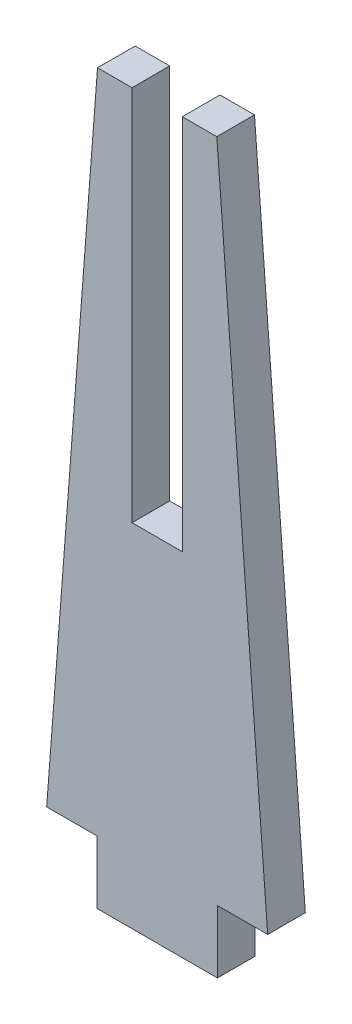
ISO-10303-21;
HEADER;
FILE_DESCRIPTION(('STEP AP214'),'2;1');
FILE_NAME('part.step','',(''),(''),'','','');
FILE_SCHEMA(('AUTOMOTIVE_DESIGN { 1 0 10303 214 1 1 1 1 }'));
ENDSEC;
DATA;
#1=APPLICATION_CONTEXT('core data for automotive mechanical design processes');
#2=APPLICATION_PROTOCOL_DEFINITION('international standard','automotive_design',2000,#1);
#3=PRODUCT_CONTEXT('',#1,'mechanical');
#4=PRODUCT('Part','Part','',(#3));
#5=PRODUCT_RELATED_PRODUCT_CATEGORY('part','',(#4));
#6=PRODUCT_DEFINITION_FORMATION('','',#4);
#7=PRODUCT_DEFINITION_CONTEXT('part definition',#1,'design');
#8=PRODUCT_DEFINITION('design','',#6,#7);
#9=PRODUCT_DEFINITION_SHAPE('','',#8);
#10=(LENGTH_UNIT() NAMED_UNIT(*) SI_UNIT(.MILLI.,.METRE.));
#11=(NAMED_UNIT(*) PLANE_ANGLE_UNIT() SI_UNIT($,.RADIAN.));
#12=(NAMED_UNIT(*) SI_UNIT($,.STERADIAN.) SOLID_ANGLE_UNIT());
#13=UNCERTAINTY_MEASURE_WITH_UNIT(LENGTH_MEASURE(1.E-05),#10,'distance_accuracy_value','');
#14=(GEOMETRIC_REPRESENTATION_CONTEXT(3) GLOBAL_UNCERTAINTY_ASSIGNED_CONTEXT((#13)) GLOBAL_UNIT_ASSIGNED_CONTEXT((#10,
#11,#12)) REPRESENTATION_CONTEXT('',''));
#15=CARTESIAN_POINT('',(0.,0.,0.));
#16=DIRECTION('',(0.,0.,1.));
#17=DIRECTION('',(1.,0.,0.));
#18=AXIS2_PLACEMENT_3D('',#15,#16,#17);
#19=CARTESIAN_POINT('',(2.,0.,3.));
#20=DIRECTION('',(-1.,0.,0.));
#21=DIRECTION('',(0.,0.,1.));
#22=AXIS2_PLACEMENT_3D('',#19,#20,#21);
#23=PLANE('',#22);
#24=DIRECTION('',(0.,1.,0.));
#25=VECTOR('',#24,1.);
#26=CARTESIAN_POINT('',(2.,0.,0.));
#27=LINE('',#26,#25);
#28=CARTESIAN_POINT('',(2.,25.5,0.));
#29=VERTEX_POINT('',#28);
#30=CARTESIAN_POINT('',(2.,55.5,0.));
#31=VERTEX_POINT('',#30);
#32=EDGE_CURVE('E168',#29,#31,#27,.T.);
#33=ORIENTED_EDGE('',*,*,#32,.F.);
#34=DIRECTION('',(0.,0.,-1.));
#35=VECTOR('',#34,1.);
#36=CARTESIAN_POINT('',(2.,25.5,3.));
#37=LINE('',#36,#35);
#38=CARTESIAN_POINT('',(2.,25.5,3.));
#39=VERTEX_POINT('',#38);
#40=EDGE_CURVE('E11',#39,#29,#37,.T.);
#41=ORIENTED_EDGE('',*,*,#40,.F.);
#42=DIRECTION('',(0.,1.,0.));
#43=VECTOR('',#42,1.);
#44=CARTESIAN_POINT('',(2.,0.,3.));
#45=LINE('',#44,#43);
#46=CARTESIAN_POINT('',(2.,55.5,3.));
#47=VERTEX_POINT('',#46);
#48=EDGE_CURVE('E209',#39,#47,#45,.T.);
#49=ORIENTED_EDGE('',*,*,#48,.T.);
#50=DIRECTION('',(0.,0.,-1.));
#51=VECTOR('',#50,1.);
#52=CARTESIAN_POINT('',(2.,55.5,3.));
#53=LINE('',#52,#51);
#54=EDGE_CURVE('E62',#47,#31,#53,.T.);
#55=ORIENTED_EDGE('',*,*,#54,.T.);
#56=EDGE_LOOP('',(#33,#41,#49,#55));
#57=FACE_BOUND('',#56,.T.);
#58=ADVANCED_FACE('F45',(#57),#23,.T.);
#59=CARTESIAN_POINT('',(0.,25.5,3.));
#60=DIRECTION('',(0.,1.,0.));
#61=DIRECTION('',(0.,0.,1.));
#62=AXIS2_PLACEMENT_3D('',#59,#60,#61);
#63=PLANE('',#62);
#64=DIRECTION('',(1.,0.,0.));
#65=VECTOR('',#64,1.);
#66=CARTESIAN_POINT('',(0.,25.5,0.));
#67=LINE('',#66,#65);
#68=CARTESIAN_POINT('',(-2.,25.5,0.));
#69=VERTEX_POINT('',#68);
#70=EDGE_CURVE('E171',#69,#29,#67,.T.);
#71=ORIENTED_EDGE('',*,*,#70,.F.);
#72=DIRECTION('',(0.,0.,-1.));
#73=VECTOR('',#72,1.);
#74=CARTESIAN_POINT('',(-2.,25.5,3.));
#75=LINE('',#74,#73);
#76=CARTESIAN_POINT('',(-2.,25.5,3.));
#77=VERTEX_POINT('',#76);
#78=EDGE_CURVE('E54',#77,#69,#75,.T.);
#79=ORIENTED_EDGE('',*,*,#78,.F.);
#80=DIRECTION('',(1.,0.,0.));
#81=VECTOR('',#80,1.);
#82=CARTESIAN_POINT('',(0.,25.5,3.));
#83=LINE('',#82,#81);
#84=EDGE_CURVE('E250',#77,#39,#83,.T.);
#85=ORIENTED_EDGE('',*,*,#84,.T.);
#86=ORIENTED_EDGE('',*,*,#40,.T.);
#87=EDGE_LOOP('',(#71,#79,#85,#86));
#88=FACE_BOUND('',#87,.T.);
#89=ADVANCED_FACE('F249',(#88),#63,.T.);
#90=CARTESIAN_POINT('',(-2.,0.,3.));
#91=DIRECTION('',(-1.,0.,0.));
#92=DIRECTION('',(0.,0.,1.));
#93=AXIS2_PLACEMENT_3D('',#90,#91,#92);
#94=PLANE('',#93);
#95=DIRECTION('',(0.,1.,0.));
#96=VECTOR('',#95,1.);
#97=CARTESIAN_POINT('',(-2.,0.,0.));
#98=LINE('',#97,#96);
#99=CARTESIAN_POINT('',(-2.,55.5,0.));
#100=VERTEX_POINT('',#99);
#101=EDGE_CURVE('E175',#69,#100,#98,.T.);
#102=ORIENTED_EDGE('',*,*,#101,.T.);
#103=DIRECTION('',(0.,0.,-1.));
#104=VECTOR('',#103,1.);
#105=CARTESIAN_POINT('',(-2.,55.5,3.));
#106=LINE('',#105,#104);
#107=CARTESIAN_POINT('',(-2.,55.5,3.));
#108=VERTEX_POINT('',#107);
#109=EDGE_CURVE('E232',#108,#100,#106,.T.);
#110=ORIENTED_EDGE('',*,*,#109,.F.);
#111=DIRECTION('',(0.,1.,0.));
#112=VECTOR('',#111,1.);
#113=CARTESIAN_POINT('',(-2.,0.,3.));
#114=LINE('',#113,#112);
#115=EDGE_CURVE('E240',#77,#108,#114,.T.);
#116=ORIENTED_EDGE('',*,*,#115,.F.);
#117=ORIENTED_EDGE('',*,*,#78,.T.);
#118=EDGE_LOOP('',(#102,#110,#116,#117));
#119=FACE_BOUND('',#118,.T.);
#120=ADVANCED_FACE('F238',(#119),#94,.F.);
#121=CARTESIAN_POINT('',(0.,55.5,3.));
#122=DIRECTION('',(0.,1.,0.));
#123=DIRECTION('',(0.,0.,1.));
#124=AXIS2_PLACEMENT_3D('',#121,#122,#123);
#125=PLANE('',#124);
#126=DIRECTION('',(1.,0.,0.));
#127=VECTOR('',#126,1.);
#128=CARTESIAN_POINT('',(0.,55.5,0.));
#129=LINE('',#128,#127);
#130=CARTESIAN_POINT('',(-4.75,55.5,0.));
#131=VERTEX_POINT('',#130);
#132=EDGE_CURVE('E179',#131,#100,#129,.T.);
#133=ORIENTED_EDGE('',*,*,#132,.F.);
#134=DIRECTION('',(0.,0.,-1.));
#135=VECTOR('',#134,1.);
#136=CARTESIAN_POINT('',(-4.75,55.5,3.));
#137=LINE('',#136,#135);
#138=CARTESIAN_POINT('',(-4.75,55.5,3.));
#139=VERTEX_POINT('',#138);
#140=EDGE_CURVE('E229',#139,#131,#137,.T.);
#141=ORIENTED_EDGE('',*,*,#140,.F.);
#142=DIRECTION('',(1.,0.,0.));
#143=VECTOR('',#142,1.);
#144=CARTESIAN_POINT('',(0.,55.5,3.));
#145=LINE('',#144,#143);
#146=EDGE_CURVE('E318',#139,#108,#145,.T.);
#147=ORIENTED_EDGE('',*,*,#146,.T.);
#148=ORIENTED_EDGE('',*,*,#109,.T.);
#149=EDGE_LOOP('',(#133,#141,#147,#148));
#150=FACE_BOUND('',#149,.T.);
#151=ADVANCED_FACE('F268',(#150),#125,.T.);
#152=CARTESIAN_POINT('',(-8.93884145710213,0.683062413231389,3.));
#153=DIRECTION('',(0.997093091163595,-0.0761929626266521,0.));
#154=DIRECTION('',(0.0761929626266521,0.997093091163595,0.));
#155=AXIS2_PLACEMENT_3D('',#152,#153,#154);
#156=PLANE('',#155);
#157=DIRECTION('',(-0.0761929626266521,-0.997093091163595,0.));
#158=VECTOR('',#157,1.);
#159=CARTESIAN_POINT('',(-8.93884145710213,0.683062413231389,0.));
#160=LINE('',#159,#158);
#161=CARTESIAN_POINT('',(-8.8,2.5,0.));
#162=VERTEX_POINT('',#161);
#163=EDGE_CURVE('E183',#131,#162,#160,.T.);
#164=ORIENTED_EDGE('',*,*,#163,.T.);
#165=DIRECTION('',(0.,0.,-1.));
#166=VECTOR('',#165,1.);
#167=CARTESIAN_POINT('',(-8.8,2.5,3.));
#168=LINE('',#167,#166);
#169=CARTESIAN_POINT('',(-8.8,2.5,3.));
#170=VERTEX_POINT('',#169);
#171=EDGE_CURVE('E226',#170,#162,#168,.T.);
#172=ORIENTED_EDGE('',*,*,#171,.F.);
#173=DIRECTION('',(-0.0761929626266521,-0.997093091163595,0.));
#174=VECTOR('',#173,1.);
#175=CARTESIAN_POINT('',(-8.93884145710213,0.683062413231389,3.));
#176=LINE('',#175,#174);
#177=EDGE_CURVE('E314',#139,#170,#176,.T.);
#178=ORIENTED_EDGE('',*,*,#177,.F.);
#179=ORIENTED_EDGE('',*,*,#140,.T.);
#180=EDGE_LOOP('',(#164,#172,#178,#179));
#181=FACE_BOUND('',#180,.T.);
#182=ADVANCED_FACE('F273',(#181),#156,.F.);
#183=CARTESIAN_POINT('',(0.,2.5,3.));
#184=DIRECTION('',(0.,-1.,0.));
#185=DIRECTION('',(1.,0.,0.));
#186=AXIS2_PLACEMENT_3D('',#183,#184,#185);
#187=PLANE('',#186);
#188=DIRECTION('',(-1.,0.,0.));
#189=VECTOR('',#188,1.);
#190=CARTESIAN_POINT('',(0.,2.5,0.));
#191=LINE('',#190,#189);
#192=CARTESIAN_POINT('',(-4.8,2.5,0.));
#193=VERTEX_POINT('',#192);
#194=EDGE_CURVE('E187',#193,#162,#191,.T.);
#195=ORIENTED_EDGE('',*,*,#194,.F.);
#196=DIRECTION('',(0.,0.,-1.));
#197=VECTOR('',#196,1.);
#198=CARTESIAN_POINT('',(-4.8,2.5,3.));
#199=LINE('',#198,#197);
#200=CARTESIAN_POINT('',(-4.8,2.5,3.));
#201=VERTEX_POINT('',#200);
#202=EDGE_CURVE('E223',#201,#193,#199,.T.);
#203=ORIENTED_EDGE('',*,*,#202,.F.);
#204=DIRECTION('',(-1.,0.,0.));
#205=VECTOR('',#204,1.);
#206=CARTESIAN_POINT('',(0.,2.5,3.));
#207=LINE('',#206,#205);
#208=EDGE_CURVE('E158',#201,#170,#207,.T.);
#209=ORIENTED_EDGE('',*,*,#208,.T.);
#210=ORIENTED_EDGE('',*,*,#171,.T.);
#211=EDGE_LOOP('',(#195,#203,#209,#210));
#212=FACE_BOUND('',#211,.T.);
#213=ADVANCED_FACE('F277',(#212),#187,.T.);
#214=CARTESIAN_POINT('',(-4.8,0.,3.));
#215=DIRECTION('',(-1.,0.,0.));
#216=DIRECTION('',(0.,0.,1.));
#217=AXIS2_PLACEMENT_3D('',#214,#215,#216);
#218=PLANE('',#217);
#219=DIRECTION('',(0.,1.,0.));
#220=VECTOR('',#219,1.);
#221=CARTESIAN_POINT('',(-4.8,0.,0.));
#222=LINE('',#221,#220);
#223=CARTESIAN_POINT('',(-4.8,-2.5,0.));
#224=VERTEX_POINT('',#223);
#225=EDGE_CURVE('E191',#224,#193,#222,.T.);
#226=ORIENTED_EDGE('',*,*,#225,.F.);
#227=DIRECTION('',(0.,0.,-1.));
#228=VECTOR('',#227,1.);
#229=CARTESIAN_POINT('',(-4.8,-2.5,3.));
#230=LINE('',#229,#228);
#231=CARTESIAN_POINT('',(-4.8,-2.5,3.));
#232=VERTEX_POINT('',#231);
#233=EDGE_CURVE('E220',#232,#224,#230,.T.);
#234=ORIENTED_EDGE('',*,*,#233,.F.);
#235=DIRECTION('',(0.,1.,0.));
#236=VECTOR('',#235,1.);
#237=CARTESIAN_POINT('',(-4.8,0.,3.));
#238=LINE('',#237,#236);
#239=EDGE_CURVE('E308',#232,#201,#238,.T.);
#240=ORIENTED_EDGE('',*,*,#239,.T.);
#241=ORIENTED_EDGE('',*,*,#202,.T.);
#242=EDGE_LOOP('',(#226,#234,#240,#241));
#243=FACE_BOUND('',#242,.T.);
#244=ADVANCED_FACE('F279',(#243),#218,.T.);
#245=CARTESIAN_POINT('',(0.,-2.5,3.));
#246=DIRECTION('',(0.,1.,0.));
#247=DIRECTION('',(0.,0.,1.));
#248=AXIS2_PLACEMENT_3D('',#245,#246,#247);
#249=PLANE('',#248);
#250=DIRECTION('',(1.,0.,0.));
#251=VECTOR('',#250,1.);
#252=CARTESIAN_POINT('',(0.,-2.5,0.));
#253=LINE('',#252,#251);
#254=CARTESIAN_POINT('',(4.8,-2.5,0.));
#255=VERTEX_POINT('',#254);
#256=EDGE_CURVE('E195',#224,#255,#253,.T.);
#257=ORIENTED_EDGE('',*,*,#256,.T.);
#258=DIRECTION('',(0.,0.,-1.));
#259=VECTOR('',#258,1.);
#260=CARTESIAN_POINT('',(4.8,-2.5,3.));
#261=LINE('',#260,#259);
#262=CARTESIAN_POINT('',(4.8,-2.5,3.));
#263=VERTEX_POINT('',#262);
#264=EDGE_CURVE('E216',#263,#255,#261,.T.);
#265=ORIENTED_EDGE('',*,*,#264,.F.);
#266=DIRECTION('',(1.,0.,0.));
#267=VECTOR('',#266,1.);
#268=CARTESIAN_POINT('',(0.,-2.5,3.));
#269=LINE('',#268,#267);
#270=EDGE_CURVE('E310',#232,#263,#269,.T.);
#271=ORIENTED_EDGE('',*,*,#270,.F.);
#272=ORIENTED_EDGE('',*,*,#233,.T.);
#273=EDGE_LOOP('',(#257,#265,#271,#272));
#274=FACE_BOUND('',#273,.T.);
#275=ADVANCED_FACE('F282',(#274),#249,.F.);
#276=CARTESIAN_POINT('',(4.8,0.,3.));
#277=DIRECTION('',(-1.,0.,0.));
#278=DIRECTION('',(0.,0.,1.));
#279=AXIS2_PLACEMENT_3D('',#276,#277,#278);
#280=PLANE('',#279);
#281=DIRECTION('',(0.,1.,0.));
#282=VECTOR('',#281,1.);
#283=CARTESIAN_POINT('',(4.8,0.,0.));
#284=LINE('',#283,#282);
#285=CARTESIAN_POINT('',(4.8,2.5,0.));
#286=VERTEX_POINT('',#285);
#287=EDGE_CURVE('E198',#255,#286,#284,.T.);
#288=ORIENTED_EDGE('',*,*,#287,.T.);
#289=DIRECTION('',(0.,0.,-1.));
#290=VECTOR('',#289,1.);
#291=CARTESIAN_POINT('',(4.8,2.5,3.));
#292=LINE('',#291,#290);
#293=CARTESIAN_POINT('',(4.8,2.5,3.));
#294=VERTEX_POINT('',#293);
#295=EDGE_CURVE('E146',#294,#286,#292,.T.);
#296=ORIENTED_EDGE('',*,*,#295,.F.);
#297=DIRECTION('',(0.,1.,0.));
#298=VECTOR('',#297,1.);
#299=CARTESIAN_POINT('',(4.8,0.,3.));
#300=LINE('',#299,#298);
#301=EDGE_CURVE('E154',#263,#294,#300,.T.);
#302=ORIENTED_EDGE('',*,*,#301,.F.);
#303=ORIENTED_EDGE('',*,*,#264,.T.);
#304=EDGE_LOOP('',(#288,#296,#302,#303));
#305=FACE_BOUND('',#304,.T.);
#306=ADVANCED_FACE('F286',(#305),#280,.F.);
#307=CARTESIAN_POINT('',(8.8,2.5,0.));
#308=VERTEX_POINT('',#307);
#309=EDGE_CURVE('E141',#308,#286,#191,.T.);
#310=ORIENTED_EDGE('',*,*,#309,.F.);
#311=DIRECTION('',(0.,0.,-1.));
#312=VECTOR('',#311,1.);
#313=CARTESIAN_POINT('',(8.8,2.5,3.));
#314=LINE('',#313,#312);
#315=CARTESIAN_POINT('',(8.8,2.5,3.));
#316=VERTEX_POINT('',#315);
#317=EDGE_CURVE('E136',#316,#308,#314,.T.);
#318=ORIENTED_EDGE('',*,*,#317,.F.);
#319=EDGE_CURVE('E139',#316,#294,#207,.T.);
#320=ORIENTED_EDGE('',*,*,#319,.T.);
#321=ORIENTED_EDGE('',*,*,#295,.T.);
#322=EDGE_LOOP('',(#310,#318,#320,#321));
#323=FACE_BOUND('',#322,.T.);
#324=ADVANCED_FACE('F138',(#323),#187,.T.);
#325=CARTESIAN_POINT('',(8.93884145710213,0.683062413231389,3.));
#326=DIRECTION('',(0.997093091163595,0.0761929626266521,0.));
#327=DIRECTION('',(-0.0761929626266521,0.997093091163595,0.));
#328=AXIS2_PLACEMENT_3D('',#325,#326,#327);
#329=PLANE('',#328);
#330=DIRECTION('',(0.0761929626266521,-0.997093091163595,0.));
#331=VECTOR('',#330,1.);
#332=CARTESIAN_POINT('',(8.93884145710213,0.683062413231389,0.));
#333=LINE('',#332,#331);
#334=CARTESIAN_POINT('',(4.75,55.5,0.));
#335=VERTEX_POINT('',#334);
#336=EDGE_CURVE('E202',#335,#308,#333,.T.);
#337=ORIENTED_EDGE('',*,*,#336,.F.);
#338=DIRECTION('',(0.,0.,-1.));
#339=VECTOR('',#338,1.);
#340=CARTESIAN_POINT('',(4.75,55.5,3.));
#341=LINE('',#340,#339);
#342=CARTESIAN_POINT('',(4.75,55.5,3.));
#343=VERTEX_POINT('',#342);
#344=EDGE_CURVE('E99',#343,#335,#341,.T.);
#345=ORIENTED_EDGE('',*,*,#344,.F.);
#346=DIRECTION('',(0.0761929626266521,-0.997093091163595,0.));
#347=VECTOR('',#346,1.);
#348=CARTESIAN_POINT('',(8.93884145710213,0.683062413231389,3.));
#349=LINE('',#348,#347);
#350=EDGE_CURVE('E152',#343,#316,#349,.T.);
#351=ORIENTED_EDGE('',*,*,#350,.T.);
#352=ORIENTED_EDGE('',*,*,#317,.T.);
#353=EDGE_LOOP('',(#337,#345,#351,#352));
#354=FACE_BOUND('',#353,.T.);
#355=ADVANCED_FACE('F159',(#354),#329,.T.);
#356=CARTESIAN_POINT('',(0.,55.5,3.));
#357=DIRECTION('',(0.,1.,0.));
#358=DIRECTION('',(0.,0.,1.));
#359=AXIS2_PLACEMENT_3D('',#356,#357,#358);
#360=PLANE('',#359);
#361=DIRECTION('',(1.,0.,0.));
#362=VECTOR('',#361,1.);
#363=CARTESIAN_POINT('',(0.,55.5,0.));
#364=LINE('',#363,#362);
#365=EDGE_CURVE('E205',#31,#335,#364,.T.);
#366=ORIENTED_EDGE('',*,*,#365,.F.);
#367=ORIENTED_EDGE('',*,*,#54,.F.);
#368=DIRECTION('',(1.,0.,0.));
#369=VECTOR('',#368,1.);
#370=CARTESIAN_POINT('',(0.,55.5,3.));
#371=LINE('',#370,#369);
#372=EDGE_CURVE('E161',#47,#343,#371,.T.);
#373=ORIENTED_EDGE('',*,*,#372,.T.);
#374=ORIENTED_EDGE('',*,*,#344,.T.);
#375=EDGE_LOOP('',(#366,#367,#373,#374));
#376=FACE_BOUND('',#375,.T.);
#377=ADVANCED_FACE('F251',(#376),#360,.T.);
#378=CARTESIAN_POINT('',(0.,0.,3.));
#379=DIRECTION('',(0.,0.,1.));
#380=DIRECTION('',(1.,0.,0.));
#381=AXIS2_PLACEMENT_3D('',#378,#379,#380);
#382=PLANE('',#381);
#383=ORIENTED_EDGE('',*,*,#48,.F.);
#384=ORIENTED_EDGE('',*,*,#84,.F.);
#385=ORIENTED_EDGE('',*,*,#115,.T.);
#386=ORIENTED_EDGE('',*,*,#146,.F.);
#387=ORIENTED_EDGE('',*,*,#177,.T.);
#388=ORIENTED_EDGE('',*,*,#208,.F.);
#389=ORIENTED_EDGE('',*,*,#239,.F.);
#390=ORIENTED_EDGE('',*,*,#270,.T.);
#391=ORIENTED_EDGE('',*,*,#301,.T.);
#392=ORIENTED_EDGE('',*,*,#319,.F.);
#393=ORIENTED_EDGE('',*,*,#350,.F.);
#394=ORIENTED_EDGE('',*,*,#372,.F.);
#395=EDGE_LOOP('',(#383,#384,#385,#386,#387,#388,#389,#390,#391,#392,#393,#394));
#396=FACE_BOUND('',#395,.T.);
#397=ADVANCED_FACE('F150',(#396),#382,.T.);
#398=CARTESIAN_POINT('',(0.,0.,0.));
#399=DIRECTION('',(0.,0.,1.));
#400=DIRECTION('',(1.,0.,0.));
#401=AXIS2_PLACEMENT_3D('',#398,#399,#400);
#402=PLANE('',#401);
#403=ORIENTED_EDGE('',*,*,#32,.T.);
#404=ORIENTED_EDGE('',*,*,#365,.T.);
#405=ORIENTED_EDGE('',*,*,#336,.T.);
#406=ORIENTED_EDGE('',*,*,#309,.T.);
#407=ORIENTED_EDGE('',*,*,#287,.F.);
#408=ORIENTED_EDGE('',*,*,#256,.F.);
#409=ORIENTED_EDGE('',*,*,#225,.T.);
#410=ORIENTED_EDGE('',*,*,#194,.T.);
#411=ORIENTED_EDGE('',*,*,#163,.F.);
#412=ORIENTED_EDGE('',*,*,#132,.T.);
#413=ORIENTED_EDGE('',*,*,#101,.F.);
#414=ORIENTED_EDGE('',*,*,#70,.T.);
#415=EDGE_LOOP('',(#403,#404,#405,#406,#407,#408,#409,#410,#411,#412,#413,#414));
#416=FACE_BOUND('',#415,.T.);
#417=ADVANCED_FACE('F246',(#416),#402,.F.);
#418=CLOSED_SHELL('',(#58,#89,#120,#151,#182,#213,#244,#275,#306,#324,#355,#377,#397,#417));
#419=MANIFOLD_SOLID_BREP('B2',#418);
#420=ADVANCED_BREP_SHAPE_REPRESENTATION('',(#18,#419),#14);
#421=SHAPE_DEFINITION_REPRESENTATION(#9,#420);
ENDSEC;
END-ISO-10303-21;
